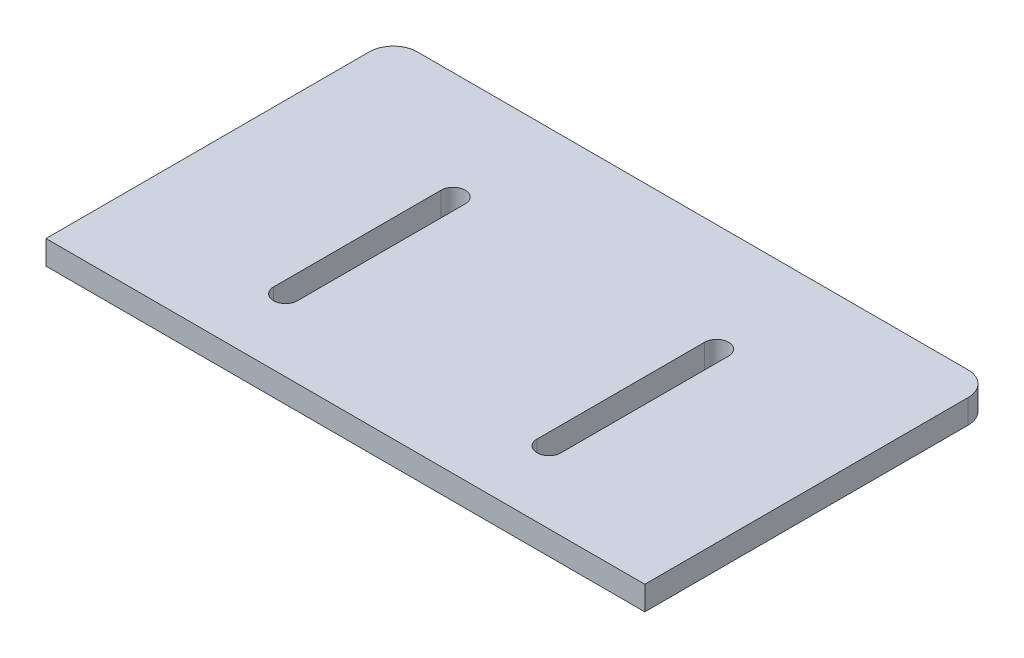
from build123d import *

# Parameters (mm, degrees)
RESSALTO_EXTRUS_O1_DEPTH = 2


with BuildPart() as part:
    # Esbo_o1 → Ressalto-extrus_o1 (new body)
    with BuildSketch(Plane(origin=(0, 0, 0), x_dir=(1, 0, 0), z_dir=(0, 1, 0))):
        with BuildLine():
            Line((-23, 14.5), (23, 14.5))
            ThreePointArc((23, 14.5), (24.414213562, 13.914213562), (25, 12.5))
            Line((25, 12.5), (25, -14.5))
            Line((25, -14.5), (-25, -14.5))
            Line((-25, -14.5), (-25, 12.5))
            ThreePointArc((-25, 12.5), (-24.414213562, 13.914213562), (-23, 14.5))
        make_face()
        with BuildLine():
            Line((-10, 5.5), (-10, -8.5))
            ThreePointArc((-10, -8.5), (-11, -9.5), (-12, -8.5))
            Line((-12, -8.5), (-12, 5.5))
            ThreePointArc((-12, 5.5), (-11, 6.5), (-10, 5.5))
        make_face(mode=Mode.SUBTRACT)
        with BuildLine():
            Line((10, 5.5), (10, -8.5))
            ThreePointArc((10, -8.5), (11, -9.5), (12, -8.5))
            Line((12, -8.5), (12, 5.5))
            ThreePointArc((12, 5.5), (11, 6.5), (10, 5.5))
        make_face(mode=Mode.SUBTRACT)
    extrude(amount=RESSALTO_EXTRUS_O1_DEPTH)


solid = part.part
